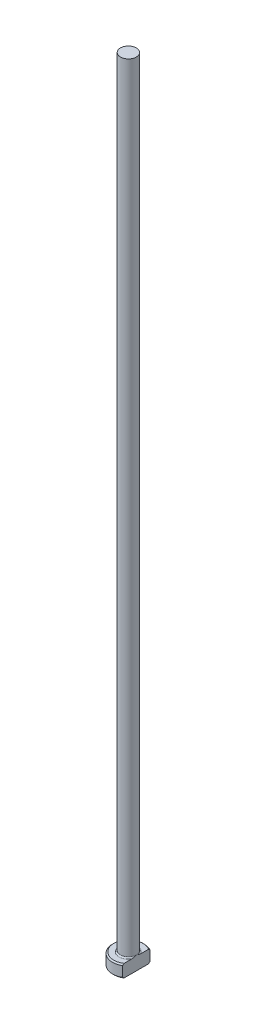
from build123d import *
from build123d.topology import SkipClean

# Parameters (mm, degrees)
CHAMFER1_SIZE = 0.2
FILLET1_R     = 0.2
KEY_DEPTH     = 126.049990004


with BuildPart() as part:
    # Sketch1 → Revolve1 (revolve)
    with BuildSketch(Plane.XY, mode=Mode.PRIVATE) as revolve1_sk:
        Polygon((0, 0), (-2.5, 0), (-2.5, 2), (-1.25, 2), (-1.25, 125), (0, 125), align=None)
    revolve(revolve1_sk.sketch.rotate(Axis((0, 259.958771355, 0), (0, -1, 0)), 270), axis=Axis((0, 259.958771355, 0), (0, -1, 0)))

    # Chamfer1
    chamfer1_edges = [part.edges().sort_by_distance(p)[0] for p in [
        (0, 2, -2.5),
        (0, 0, -2.5),
    ]]
    chamfer(chamfer1_edges, length=CHAMFER1_SIZE)

    # Fillet1
    fillet1_edges = [part.edges().sort_by_distance(p)[0] for p in [
        (0, 2, -1.25),
    ]]
    fillet(fillet1_edges, radius=FILLET1_R)

    # Sketch2 → KEY (cut, through all)
    with SkipClean():  # the faces are left unmerged after this step: merging them gives an invalid solid
        with BuildSketch(Plane(origin=(0, 0, 0), x_dir=(1, 0, 0), z_dir=(0, 1, 0))):
            with BuildLine():
                Line((1.25, 2.165063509), (1.25, -2.165063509))
                ThreePointArc((1.25, -2.165063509), (2.5, 0), (1.25, 2.165063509))
            make_face()
        extrude(amount=KEY_DEPTH, mode=Mode.SUBTRACT)


solid = part.part
